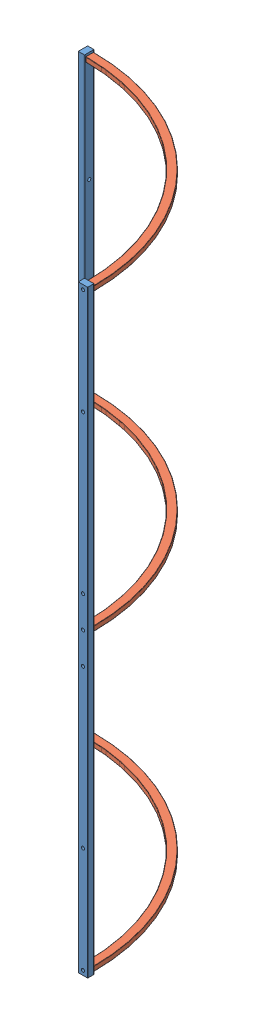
SolidWorks assembly 02Rxx-xxx_Ram(02R90-190)-1.sldasm, configuration Default (file format 4400). Lengths in mm.
Overall size (664 1900 664).
5 component instances, 2 part files, 0 mates.
Components (placement in the parent):
- 20x30(1900)-1-1: 20x30(1900)-1.sldprt [Default] at origin size (20 1900 30)
- 20x30(1900)-1-2: 20x30(1900)-1.sldprt [Default] at (639 0 639) x (0 0 -1) z (1 0 0) size (20 1900 30)
- 2515100-R90(2515100-R90)-1: 2515100-R90(2515100-R90).sldprt [Default] at (10 -935.5 629) x (0 0 1) z (-1 0 0) size (643 15 643)
- 2515100-R90(2515100-R90)-2: 2515100-R90(2515100-R90).sldprt [Default] at (10 0 629) x (0 0 1) z (-1 0 0) size (643 15 643)
- 2515100-R90(2515100-R90)-3: 2515100-R90(2515100-R90).sldprt [Default] at (10 935.5 629) x (0 0 1) z (-1 0 0) size (643 15 643)
